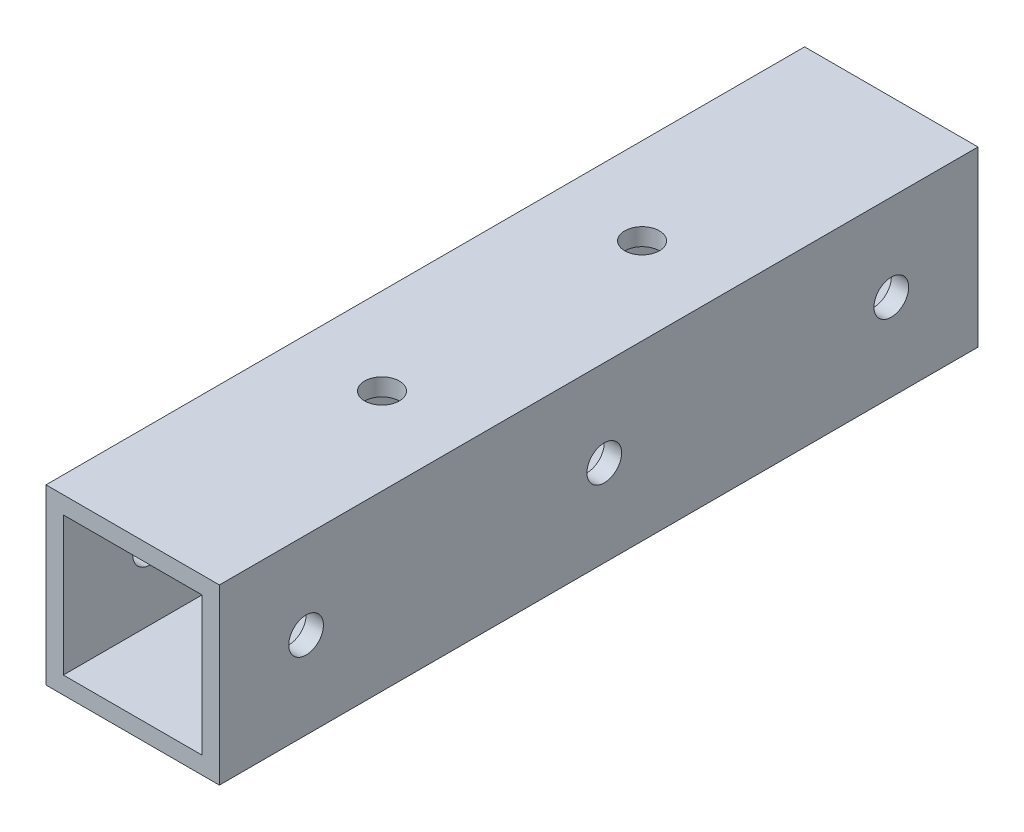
ISO-10303-21;
HEADER;
FILE_DESCRIPTION(('STEP AP214'),'2;1');
FILE_NAME('part.step','',(''),(''),'','','');
FILE_SCHEMA(('AUTOMOTIVE_DESIGN { 1 0 10303 214 1 1 1 1 }'));
ENDSEC;
DATA;
#1=APPLICATION_CONTEXT('core data for automotive mechanical design processes');
#2=APPLICATION_PROTOCOL_DEFINITION('international standard','automotive_design',2000,#1);
#3=PRODUCT_CONTEXT('',#1,'mechanical');
#4=PRODUCT('Part','Part','',(#3));
#5=PRODUCT_RELATED_PRODUCT_CATEGORY('part','',(#4));
#6=PRODUCT_DEFINITION_FORMATION('','',#4);
#7=PRODUCT_DEFINITION_CONTEXT('part definition',#1,'design');
#8=PRODUCT_DEFINITION('design','',#6,#7);
#9=PRODUCT_DEFINITION_SHAPE('','',#8);
#10=(LENGTH_UNIT() NAMED_UNIT(*) SI_UNIT(.MILLI.,.METRE.));
#11=(NAMED_UNIT(*) PLANE_ANGLE_UNIT() SI_UNIT($,.RADIAN.));
#12=(NAMED_UNIT(*) SI_UNIT($,.STERADIAN.) SOLID_ANGLE_UNIT());
#13=UNCERTAINTY_MEASURE_WITH_UNIT(LENGTH_MEASURE(1.E-05),#10,'distance_accuracy_value','');
#14=(GEOMETRIC_REPRESENTATION_CONTEXT(3) GLOBAL_UNCERTAINTY_ASSIGNED_CONTEXT((#13)) GLOBAL_UNIT_ASSIGNED_CONTEXT((#10,
#11,#12)) REPRESENTATION_CONTEXT('',''));
#15=CARTESIAN_POINT('',(0.,0.,0.));
#16=DIRECTION('',(0.,0.,1.));
#17=DIRECTION('',(1.,0.,0.));
#18=AXIS2_PLACEMENT_3D('',#15,#16,#17);
#19=CARTESIAN_POINT('',(0.,0.,87.5));
#20=DIRECTION('',(0.,0.,1.));
#21=DIRECTION('',(1.,0.,0.));
#22=AXIS2_PLACEMENT_3D('',#19,#20,#21);
#23=PLANE('',#22);
#24=DIRECTION('',(0.,1.,0.));
#25=VECTOR('',#24,1.);
#26=CARTESIAN_POINT('',(10.,10.,87.5));
#27=LINE('',#26,#25);
#28=CARTESIAN_POINT('',(10.,-10.,87.5));
#29=VERTEX_POINT('',#28);
#30=CARTESIAN_POINT('',(10.,10.,87.5));
#31=VERTEX_POINT('',#30);
#32=EDGE_CURVE('E140',#29,#31,#27,.T.);
#33=ORIENTED_EDGE('',*,*,#32,.T.);
#34=DIRECTION('',(-1.,0.,0.));
#35=VECTOR('',#34,1.);
#36=CARTESIAN_POINT('',(-10.,10.,87.5));
#37=LINE('',#36,#35);
#38=CARTESIAN_POINT('',(-10.,10.,87.5));
#39=VERTEX_POINT('',#38);
#40=EDGE_CURVE('E143',#31,#39,#37,.T.);
#41=ORIENTED_EDGE('',*,*,#40,.T.);
#42=DIRECTION('',(0.,-1.,0.));
#43=VECTOR('',#42,1.);
#44=CARTESIAN_POINT('',(-10.,10.,87.5));
#45=LINE('',#44,#43);
#46=CARTESIAN_POINT('',(-9.99999999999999,-10.,87.5));
#47=VERTEX_POINT('',#46);
#48=EDGE_CURVE('E146',#39,#47,#45,.T.);
#49=ORIENTED_EDGE('',*,*,#48,.T.);
#50=DIRECTION('',(1.,0.,0.));
#51=VECTOR('',#50,1.);
#52=CARTESIAN_POINT('',(-9.99999999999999,-10.,87.5));
#53=LINE('',#52,#51);
#54=EDGE_CURVE('E148',#47,#29,#53,.T.);
#55=ORIENTED_EDGE('',*,*,#54,.T.);
#56=EDGE_LOOP('',(#33,#41,#49,#55));
#57=FACE_BOUND('',#56,.T.);
#58=DIRECTION('',(1.,0.,0.));
#59=VECTOR('',#58,1.);
#60=CARTESIAN_POINT('',(-8.,-8.,87.5));
#61=LINE('',#60,#59);
#62=CARTESIAN_POINT('',(-8.,-8.,87.5));
#63=VERTEX_POINT('',#62);
#64=CARTESIAN_POINT('',(8.,-8.,87.5));
#65=VERTEX_POINT('',#64);
#66=EDGE_CURVE('E110',#63,#65,#61,.T.);
#67=ORIENTED_EDGE('',*,*,#66,.F.);
#68=DIRECTION('',(0.,-1.,0.));
#69=VECTOR('',#68,1.);
#70=CARTESIAN_POINT('',(-8.,8.,87.5));
#71=LINE('',#70,#69);
#72=CARTESIAN_POINT('',(-8.,8.,87.5));
#73=VERTEX_POINT('',#72);
#74=EDGE_CURVE('E102',#73,#63,#71,.T.);
#75=ORIENTED_EDGE('',*,*,#74,.F.);
#76=DIRECTION('',(-1.,0.,0.));
#77=VECTOR('',#76,1.);
#78=CARTESIAN_POINT('',(-8.,8.,87.5));
#79=LINE('',#78,#77);
#80=CARTESIAN_POINT('',(8.,8.,87.5));
#81=VERTEX_POINT('',#80);
#82=EDGE_CURVE('E124',#81,#73,#79,.T.);
#83=ORIENTED_EDGE('',*,*,#82,.F.);
#84=DIRECTION('',(0.,1.,0.));
#85=VECTOR('',#84,1.);
#86=CARTESIAN_POINT('',(8.,8.,87.5));
#87=LINE('',#86,#85);
#88=EDGE_CURVE('E122',#65,#81,#87,.T.);
#89=ORIENTED_EDGE('',*,*,#88,.F.);
#90=EDGE_LOOP('',(#67,#75,#83,#89));
#91=FACE_BOUND('',#90,.T.);
#92=ADVANCED_FACE('F35',(#57,#91),#23,.T.);
#93=CARTESIAN_POINT('',(0.,0.,0.));
#94=DIRECTION('',(0.,0.,1.));
#95=DIRECTION('',(1.,0.,0.));
#96=AXIS2_PLACEMENT_3D('',#93,#94,#95);
#97=PLANE('',#96);
#98=DIRECTION('',(0.,1.,0.));
#99=VECTOR('',#98,1.);
#100=CARTESIAN_POINT('',(10.,10.,0.));
#101=LINE('',#100,#99);
#102=CARTESIAN_POINT('',(10.,-10.,0.));
#103=VERTEX_POINT('',#102);
#104=CARTESIAN_POINT('',(10.,10.,0.));
#105=VERTEX_POINT('',#104);
#106=EDGE_CURVE('E118',#103,#105,#101,.T.);
#107=ORIENTED_EDGE('',*,*,#106,.F.);
#108=DIRECTION('',(1.,0.,0.));
#109=VECTOR('',#108,1.);
#110=CARTESIAN_POINT('',(-9.99999999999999,-10.,0.));
#111=LINE('',#110,#109);
#112=CARTESIAN_POINT('',(-9.99999999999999,-10.,0.));
#113=VERTEX_POINT('',#112);
#114=EDGE_CURVE('E144',#113,#103,#111,.T.);
#115=ORIENTED_EDGE('',*,*,#114,.F.);
#116=DIRECTION('',(0.,-1.,0.));
#117=VECTOR('',#116,1.);
#118=CARTESIAN_POINT('',(-10.,10.,0.));
#119=LINE('',#118,#117);
#120=CARTESIAN_POINT('',(-10.,10.,0.));
#121=VERTEX_POINT('',#120);
#122=EDGE_CURVE('E155',#121,#113,#119,.T.);
#123=ORIENTED_EDGE('',*,*,#122,.F.);
#124=DIRECTION('',(-1.,0.,0.));
#125=VECTOR('',#124,1.);
#126=CARTESIAN_POINT('',(-10.,10.,0.));
#127=LINE('',#126,#125);
#128=EDGE_CURVE('E153',#105,#121,#127,.T.);
#129=ORIENTED_EDGE('',*,*,#128,.F.);
#130=EDGE_LOOP('',(#107,#115,#123,#129));
#131=FACE_BOUND('',#130,.T.);
#132=DIRECTION('',(0.,-1.,0.));
#133=VECTOR('',#132,1.);
#134=CARTESIAN_POINT('',(-8.,8.,0.));
#135=LINE('',#134,#133);
#136=CARTESIAN_POINT('',(-8.,8.,0.));
#137=VERTEX_POINT('',#136);
#138=CARTESIAN_POINT('',(-8.,-8.,0.));
#139=VERTEX_POINT('',#138);
#140=EDGE_CURVE('E60',#137,#139,#135,.T.);
#141=ORIENTED_EDGE('',*,*,#140,.T.);
#142=DIRECTION('',(1.,0.,0.));
#143=VECTOR('',#142,1.);
#144=CARTESIAN_POINT('',(-8.,-8.,0.));
#145=LINE('',#144,#143);
#146=CARTESIAN_POINT('',(8.,-8.,0.));
#147=VERTEX_POINT('',#146);
#148=EDGE_CURVE('E117',#139,#147,#145,.T.);
#149=ORIENTED_EDGE('',*,*,#148,.T.);
#150=DIRECTION('',(0.,1.,0.));
#151=VECTOR('',#150,1.);
#152=CARTESIAN_POINT('',(8.,8.,0.));
#153=LINE('',#152,#151);
#154=CARTESIAN_POINT('',(8.,8.,0.));
#155=VERTEX_POINT('',#154);
#156=EDGE_CURVE('E132',#147,#155,#153,.T.);
#157=ORIENTED_EDGE('',*,*,#156,.T.);
#158=DIRECTION('',(-1.,0.,0.));
#159=VECTOR('',#158,1.);
#160=CARTESIAN_POINT('',(-8.,8.,0.));
#161=LINE('',#160,#159);
#162=EDGE_CURVE('E111',#155,#137,#161,.T.);
#163=ORIENTED_EDGE('',*,*,#162,.T.);
#164=EDGE_LOOP('',(#141,#149,#157,#163));
#165=FACE_BOUND('',#164,.T.);
#166=ADVANCED_FACE('F238',(#131,#165),#97,.F.);
#167=CARTESIAN_POINT('',(10.,10.,87.5));
#168=DIRECTION('',(-1.,0.,0.));
#169=DIRECTION('',(0.,-1.,0.));
#170=AXIS2_PLACEMENT_3D('',#167,#168,#169);
#171=PLANE('',#170);
#172=CARTESIAN_POINT('',(10.,-5.0038098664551E-12,10.0000000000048));
#173=DIRECTION('',(-1.,0.,0.));
#174=DIRECTION('',(0.,0.,1.));
#175=AXIS2_PLACEMENT_3D('',#172,#173,#174);
#176=CIRCLE('',#175,2.);
#177=CARTESIAN_POINT('',(10.,-5.0038098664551E-12,12.0000000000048));
#178=VERTEX_POINT('',#177);
#179=EDGE_CURVE('E177',#178,#178,#176,.T.);
#180=ORIENTED_EDGE('',*,*,#179,.T.);
#181=EDGE_LOOP('',(#180));
#182=FACE_BOUND('',#181,.T.);
#183=CARTESIAN_POINT('',(10.,-4.99687097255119E-12,43.1090522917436));
#184=DIRECTION('',(-1.,0.,0.));
#185=DIRECTION('',(0.,0.,1.));
#186=AXIS2_PLACEMENT_3D('',#183,#184,#185);
#187=CIRCLE('',#186,2.);
#188=CARTESIAN_POINT('',(10.,-4.99687097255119E-12,45.1090522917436));
#189=VERTEX_POINT('',#188);
#190=EDGE_CURVE('E173',#189,#189,#187,.T.);
#191=ORIENTED_EDGE('',*,*,#190,.T.);
#192=EDGE_LOOP('',(#191));
#193=FACE_BOUND('',#192,.T.);
#194=CARTESIAN_POINT('',(10.,-4.98993207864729E-12,77.5000000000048));
#195=DIRECTION('',(-1.,0.,0.));
#196=DIRECTION('',(0.,0.,1.));
#197=AXIS2_PLACEMENT_3D('',#194,#195,#196);
#198=CIRCLE('',#197,2.);
#199=CARTESIAN_POINT('',(10.,-4.98993207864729E-12,79.5000000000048));
#200=VERTEX_POINT('',#199);
#201=EDGE_CURVE('E168',#200,#200,#198,.T.);
#202=ORIENTED_EDGE('',*,*,#201,.T.);
#203=EDGE_LOOP('',(#202));
#204=FACE_BOUND('',#203,.T.);
#205=ORIENTED_EDGE('',*,*,#106,.T.);
#206=DIRECTION('',(0.,0.,-1.));
#207=VECTOR('',#206,1.);
#208=CARTESIAN_POINT('',(10.,10.,87.5));
#209=LINE('',#208,#207);
#210=EDGE_CURVE('E11',#31,#105,#209,.T.);
#211=ORIENTED_EDGE('',*,*,#210,.F.);
#212=ORIENTED_EDGE('',*,*,#32,.F.);
#213=DIRECTION('',(0.,0.,-1.));
#214=VECTOR('',#213,1.);
#215=CARTESIAN_POINT('',(10.,-10.,87.5));
#216=LINE('',#215,#214);
#217=EDGE_CURVE('E150',#29,#103,#216,.T.);
#218=ORIENTED_EDGE('',*,*,#217,.T.);
#219=EDGE_LOOP('',(#205,#211,#212,#218));
#220=FACE_BOUND('',#219,.T.);
#221=ADVANCED_FACE('F37',(#182,#193,#204,#220),#171,.F.);
#222=CARTESIAN_POINT('',(-10.,10.,87.5));
#223=DIRECTION('',(0.,-1.,0.));
#224=DIRECTION('',(0.,0.,-1.));
#225=AXIS2_PLACEMENT_3D('',#222,#223,#224);
#226=PLANE('',#225);
#227=CARTESIAN_POINT('',(0.,10.,58.75));
#228=DIRECTION('',(0.,1.,0.));
#229=DIRECTION('',(0.,0.,1.));
#230=AXIS2_PLACEMENT_3D('',#227,#228,#229);
#231=CIRCLE('',#230,1.99999999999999);
#232=CARTESIAN_POINT('',(0.,10.,60.75));
#233=VERTEX_POINT('',#232);
#234=EDGE_CURVE('E258',#233,#233,#231,.T.);
#235=ORIENTED_EDGE('',*,*,#234,.F.);
#236=EDGE_LOOP('',(#235));
#237=FACE_BOUND('',#236,.T.);
#238=CARTESIAN_POINT('',(0.,10.,28.75));
#239=DIRECTION('',(0.,1.,0.));
#240=DIRECTION('',(0.,0.,1.));
#241=AXIS2_PLACEMENT_3D('',#238,#239,#240);
#242=CIRCLE('',#241,1.99999999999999);
#243=CARTESIAN_POINT('',(0.,10.,30.75));
#244=VERTEX_POINT('',#243);
#245=EDGE_CURVE('E188',#244,#244,#242,.T.);
#246=ORIENTED_EDGE('',*,*,#245,.F.);
#247=EDGE_LOOP('',(#246));
#248=FACE_BOUND('',#247,.T.);
#249=ORIENTED_EDGE('',*,*,#128,.T.);
#250=DIRECTION('',(0.,0.,-1.));
#251=VECTOR('',#250,1.);
#252=CARTESIAN_POINT('',(-10.,10.,87.5));
#253=LINE('',#252,#251);
#254=EDGE_CURVE('E44',#39,#121,#253,.T.);
#255=ORIENTED_EDGE('',*,*,#254,.F.);
#256=ORIENTED_EDGE('',*,*,#40,.F.);
#257=ORIENTED_EDGE('',*,*,#210,.T.);
#258=EDGE_LOOP('',(#249,#255,#256,#257));
#259=FACE_BOUND('',#258,.T.);
#260=ADVANCED_FACE('F247',(#237,#248,#259),#226,.F.);
#261=CARTESIAN_POINT('',(-10.,10.,87.5));
#262=DIRECTION('',(1.,0.,0.));
#263=DIRECTION('',(0.,1.,0.));
#264=AXIS2_PLACEMENT_3D('',#261,#262,#263);
#265=PLANE('',#264);
#266=CARTESIAN_POINT('',(-10.,-5.0038098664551E-12,10.0000000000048));
#267=DIRECTION('',(-1.,0.,0.));
#268=DIRECTION('',(0.,0.,1.));
#269=AXIS2_PLACEMENT_3D('',#266,#267,#268);
#270=CIRCLE('',#269,1.99999999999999);
#271=CARTESIAN_POINT('',(-10.,-5.0038098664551E-12,12.0000000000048));
#272=VERTEX_POINT('',#271);
#273=EDGE_CURVE('E185',#272,#272,#270,.T.);
#274=ORIENTED_EDGE('',*,*,#273,.F.);
#275=EDGE_LOOP('',(#274));
#276=FACE_BOUND('',#275,.T.);
#277=CARTESIAN_POINT('',(-10.,-4.99687097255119E-12,43.1090522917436));
#278=DIRECTION('',(-1.,0.,0.));
#279=DIRECTION('',(0.,0.,1.));
#280=AXIS2_PLACEMENT_3D('',#277,#278,#279);
#281=CIRCLE('',#280,1.99999999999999);
#282=CARTESIAN_POINT('',(-10.,-4.99687097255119E-12,45.1090522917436));
#283=VERTEX_POINT('',#282);
#284=EDGE_CURVE('E203',#283,#283,#281,.T.);
#285=ORIENTED_EDGE('',*,*,#284,.F.);
#286=EDGE_LOOP('',(#285));
#287=FACE_BOUND('',#286,.T.);
#288=CARTESIAN_POINT('',(-10.,-4.98993207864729E-12,77.5000000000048));
#289=DIRECTION('',(-1.,0.,0.));
#290=DIRECTION('',(0.,0.,1.));
#291=AXIS2_PLACEMENT_3D('',#288,#289,#290);
#292=CIRCLE('',#291,1.99999999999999);
#293=CARTESIAN_POINT('',(-10.,-4.98993207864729E-12,79.5000000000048));
#294=VERTEX_POINT('',#293);
#295=EDGE_CURVE('E210',#294,#294,#292,.T.);
#296=ORIENTED_EDGE('',*,*,#295,.F.);
#297=EDGE_LOOP('',(#296));
#298=FACE_BOUND('',#297,.T.);
#299=ORIENTED_EDGE('',*,*,#122,.T.);
#300=DIRECTION('',(0.,0.,-1.));
#301=VECTOR('',#300,1.);
#302=CARTESIAN_POINT('',(-9.99999999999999,-10.,87.5));
#303=LINE('',#302,#301);
#304=EDGE_CURVE('E160',#47,#113,#303,.T.);
#305=ORIENTED_EDGE('',*,*,#304,.F.);
#306=ORIENTED_EDGE('',*,*,#48,.F.);
#307=ORIENTED_EDGE('',*,*,#254,.T.);
#308=EDGE_LOOP('',(#299,#305,#306,#307));
#309=FACE_BOUND('',#308,.T.);
#310=ADVANCED_FACE('F231',(#276,#287,#298,#309),#265,.F.);
#311=CARTESIAN_POINT('',(-9.99999999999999,-10.,87.5));
#312=DIRECTION('',(0.,1.,0.));
#313=DIRECTION('',(0.,0.,1.));
#314=AXIS2_PLACEMENT_3D('',#311,#312,#313);
#315=PLANE('',#314);
#316=CARTESIAN_POINT('',(0.,-10.,58.75));
#317=DIRECTION('',(0.,1.,0.));
#318=DIRECTION('',(0.,0.,1.));
#319=AXIS2_PLACEMENT_3D('',#316,#317,#318);
#320=CIRCLE('',#319,2.);
#321=CARTESIAN_POINT('',(0.,-10.,60.75));
#322=VERTEX_POINT('',#321);
#323=EDGE_CURVE('E318',#322,#322,#320,.T.);
#324=ORIENTED_EDGE('',*,*,#323,.T.);
#325=EDGE_LOOP('',(#324));
#326=FACE_BOUND('',#325,.T.);
#327=CARTESIAN_POINT('',(0.,-10.,28.75));
#328=DIRECTION('',(0.,1.,0.));
#329=DIRECTION('',(0.,0.,1.));
#330=AXIS2_PLACEMENT_3D('',#327,#328,#329);
#331=CIRCLE('',#330,2.);
#332=CARTESIAN_POINT('',(0.,-10.,30.75));
#333=VERTEX_POINT('',#332);
#334=EDGE_CURVE('E181',#333,#333,#331,.T.);
#335=ORIENTED_EDGE('',*,*,#334,.T.);
#336=EDGE_LOOP('',(#335));
#337=FACE_BOUND('',#336,.T.);
#338=ORIENTED_EDGE('',*,*,#114,.T.);
#339=ORIENTED_EDGE('',*,*,#217,.F.);
#340=ORIENTED_EDGE('',*,*,#54,.F.);
#341=ORIENTED_EDGE('',*,*,#304,.T.);
#342=EDGE_LOOP('',(#338,#339,#340,#341));
#343=FACE_BOUND('',#342,.T.);
#344=ADVANCED_FACE('F221',(#326,#337,#343),#315,.F.);
#345=CARTESIAN_POINT('',(-8.,8.,87.5));
#346=DIRECTION('',(1.,0.,0.));
#347=DIRECTION('',(0.,0.,-1.));
#348=AXIS2_PLACEMENT_3D('',#345,#346,#347);
#349=PLANE('',#348);
#350=CARTESIAN_POINT('',(-8.,-5.0038098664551E-12,10.0000000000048));
#351=DIRECTION('',(1.,0.,0.));
#352=DIRECTION('',(0.,0.,-1.));
#353=AXIS2_PLACEMENT_3D('',#350,#351,#352);
#354=CIRCLE('',#353,1.99999999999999);
#355=CARTESIAN_POINT('',(-8.,-5.0038098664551E-12,8.00000000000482));
#356=VERTEX_POINT('',#355);
#357=EDGE_CURVE('E176',#356,#356,#354,.T.);
#358=ORIENTED_EDGE('',*,*,#357,.F.);
#359=EDGE_LOOP('',(#358));
#360=FACE_BOUND('',#359,.T.);
#361=CARTESIAN_POINT('',(-8.,-4.99687097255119E-12,43.1090522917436));
#362=DIRECTION('',(1.,0.,0.));
#363=DIRECTION('',(0.,0.,-1.));
#364=AXIS2_PLACEMENT_3D('',#361,#362,#363);
#365=CIRCLE('',#364,1.99999999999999);
#366=CARTESIAN_POINT('',(-8.,-4.99687097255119E-12,41.1090522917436));
#367=VERTEX_POINT('',#366);
#368=EDGE_CURVE('E169',#367,#367,#365,.T.);
#369=ORIENTED_EDGE('',*,*,#368,.F.);
#370=EDGE_LOOP('',(#369));
#371=FACE_BOUND('',#370,.T.);
#372=CARTESIAN_POINT('',(-8.,-4.98993207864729E-12,77.5000000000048));
#373=DIRECTION('',(1.,0.,0.));
#374=DIRECTION('',(0.,0.,-1.));
#375=AXIS2_PLACEMENT_3D('',#372,#373,#374);
#376=CIRCLE('',#375,1.99999999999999);
#377=CARTESIAN_POINT('',(-8.,-4.98993207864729E-12,75.5000000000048));
#378=VERTEX_POINT('',#377);
#379=EDGE_CURVE('E130',#378,#378,#376,.T.);
#380=ORIENTED_EDGE('',*,*,#379,.F.);
#381=EDGE_LOOP('',(#380));
#382=FACE_BOUND('',#381,.T.);
#383=ORIENTED_EDGE('',*,*,#140,.F.);
#384=DIRECTION('',(0.,0.,-1.));
#385=VECTOR('',#384,1.);
#386=CARTESIAN_POINT('',(-8.,8.,87.5));
#387=LINE('',#386,#385);
#388=EDGE_CURVE('E106',#73,#137,#387,.T.);
#389=ORIENTED_EDGE('',*,*,#388,.F.);
#390=ORIENTED_EDGE('',*,*,#74,.T.);
#391=DIRECTION('',(0.,0.,-1.));
#392=VECTOR('',#391,1.);
#393=CARTESIAN_POINT('',(-8.,-8.,87.5));
#394=LINE('',#393,#392);
#395=EDGE_CURVE('E105',#63,#139,#394,.T.);
#396=ORIENTED_EDGE('',*,*,#395,.T.);
#397=EDGE_LOOP('',(#383,#389,#390,#396));
#398=FACE_BOUND('',#397,.T.);
#399=ADVANCED_FACE('F104',(#360,#371,#382,#398),#349,.T.);
#400=CARTESIAN_POINT('',(-8.,-8.,87.5));
#401=DIRECTION('',(0.,1.,0.));
#402=DIRECTION('',(-1.,0.,0.));
#403=AXIS2_PLACEMENT_3D('',#400,#401,#402);
#404=PLANE('',#403);
#405=CARTESIAN_POINT('',(0.,-8.,58.75));
#406=DIRECTION('',(0.,1.,0.));
#407=DIRECTION('',(-1.,0.,0.));
#408=AXIS2_PLACEMENT_3D('',#405,#406,#407);
#409=CIRCLE('',#408,1.99999999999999);
#410=CARTESIAN_POINT('',(-1.99999999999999,-8.,58.75));
#411=VERTEX_POINT('',#410);
#412=EDGE_CURVE('E193',#411,#411,#409,.T.);
#413=ORIENTED_EDGE('',*,*,#412,.F.);
#414=EDGE_LOOP('',(#413));
#415=FACE_BOUND('',#414,.T.);
#416=CARTESIAN_POINT('',(0.,-8.,28.75));
#417=DIRECTION('',(0.,1.,0.));
#418=DIRECTION('',(-1.,0.,0.));
#419=AXIS2_PLACEMENT_3D('',#416,#417,#418);
#420=CIRCLE('',#419,1.99999999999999);
#421=CARTESIAN_POINT('',(-1.99999999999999,-8.,28.75));
#422=VERTEX_POINT('',#421);
#423=EDGE_CURVE('E180',#422,#422,#420,.T.);
#424=ORIENTED_EDGE('',*,*,#423,.F.);
#425=EDGE_LOOP('',(#424));
#426=FACE_BOUND('',#425,.T.);
#427=ORIENTED_EDGE('',*,*,#148,.F.);
#428=ORIENTED_EDGE('',*,*,#395,.F.);
#429=ORIENTED_EDGE('',*,*,#66,.T.);
#430=DIRECTION('',(0.,0.,-1.));
#431=VECTOR('',#430,1.);
#432=CARTESIAN_POINT('',(8.,-8.,87.5));
#433=LINE('',#432,#431);
#434=EDGE_CURVE('E119',#65,#147,#433,.T.);
#435=ORIENTED_EDGE('',*,*,#434,.T.);
#436=EDGE_LOOP('',(#427,#428,#429,#435));
#437=FACE_BOUND('',#436,.T.);
#438=ADVANCED_FACE('F114',(#415,#426,#437),#404,.T.);
#439=CARTESIAN_POINT('',(8.,8.,87.5));
#440=DIRECTION('',(-1.,0.,0.));
#441=DIRECTION('',(0.,0.,1.));
#442=AXIS2_PLACEMENT_3D('',#439,#440,#441);
#443=PLANE('',#442);
#444=CARTESIAN_POINT('',(8.,-5.0038098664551E-12,10.0000000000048));
#445=DIRECTION('',(-1.,0.,0.));
#446=DIRECTION('',(0.,0.,1.));
#447=AXIS2_PLACEMENT_3D('',#444,#445,#446);
#448=CIRCLE('',#447,1.99999999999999);
#449=CARTESIAN_POINT('',(8.,-5.0038098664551E-12,12.0000000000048));
#450=VERTEX_POINT('',#449);
#451=EDGE_CURVE('E174',#450,#450,#448,.T.);
#452=ORIENTED_EDGE('',*,*,#451,.F.);
#453=EDGE_LOOP('',(#452));
#454=FACE_BOUND('',#453,.T.);
#455=CARTESIAN_POINT('',(8.,-4.99687097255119E-12,43.1090522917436));
#456=DIRECTION('',(-1.,0.,0.));
#457=DIRECTION('',(0.,0.,1.));
#458=AXIS2_PLACEMENT_3D('',#455,#456,#457);
#459=CIRCLE('',#458,1.99999999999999);
#460=CARTESIAN_POINT('',(8.,-4.99687097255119E-12,45.1090522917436));
#461=VERTEX_POINT('',#460);
#462=EDGE_CURVE('E172',#461,#461,#459,.T.);
#463=ORIENTED_EDGE('',*,*,#462,.F.);
#464=EDGE_LOOP('',(#463));
#465=FACE_BOUND('',#464,.T.);
#466=CARTESIAN_POINT('',(8.,-4.98993207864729E-12,77.5000000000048));
#467=DIRECTION('',(-1.,0.,0.));
#468=DIRECTION('',(0.,0.,1.));
#469=AXIS2_PLACEMENT_3D('',#466,#467,#468);
#470=CIRCLE('',#469,1.99999999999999);
#471=CARTESIAN_POINT('',(8.,-4.98993207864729E-12,79.5000000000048));
#472=VERTEX_POINT('',#471);
#473=EDGE_CURVE('E165',#472,#472,#470,.T.);
#474=ORIENTED_EDGE('',*,*,#473,.F.);
#475=EDGE_LOOP('',(#474));
#476=FACE_BOUND('',#475,.T.);
#477=ORIENTED_EDGE('',*,*,#156,.F.);
#478=ORIENTED_EDGE('',*,*,#434,.F.);
#479=ORIENTED_EDGE('',*,*,#88,.T.);
#480=DIRECTION('',(0.,0.,-1.));
#481=VECTOR('',#480,1.);
#482=CARTESIAN_POINT('',(8.,8.,87.5));
#483=LINE('',#482,#481);
#484=EDGE_CURVE('E52',#81,#155,#483,.T.);
#485=ORIENTED_EDGE('',*,*,#484,.T.);
#486=EDGE_LOOP('',(#477,#478,#479,#485));
#487=FACE_BOUND('',#486,.T.);
#488=ADVANCED_FACE('F228',(#454,#465,#476,#487),#443,.T.);
#489=CARTESIAN_POINT('',(-8.,8.,87.5));
#490=DIRECTION('',(0.,-1.,0.));
#491=DIRECTION('',(0.,0.,-1.));
#492=AXIS2_PLACEMENT_3D('',#489,#490,#491);
#493=PLANE('',#492);
#494=CARTESIAN_POINT('',(0.,8.,58.75));
#495=DIRECTION('',(0.,-1.,0.));
#496=DIRECTION('',(0.,0.,-1.));
#497=AXIS2_PLACEMENT_3D('',#494,#495,#496);
#498=CIRCLE('',#497,1.99999999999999);
#499=CARTESIAN_POINT('',(0.,8.,56.75));
#500=VERTEX_POINT('',#499);
#501=EDGE_CURVE('E39',#500,#500,#498,.T.);
#502=ORIENTED_EDGE('',*,*,#501,.F.);
#503=EDGE_LOOP('',(#502));
#504=FACE_BOUND('',#503,.T.);
#505=CARTESIAN_POINT('',(0.,8.,28.75));
#506=DIRECTION('',(0.,-1.,0.));
#507=DIRECTION('',(0.,0.,-1.));
#508=AXIS2_PLACEMENT_3D('',#505,#506,#507);
#509=CIRCLE('',#508,1.99999999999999);
#510=CARTESIAN_POINT('',(0.,8.,26.75));
#511=VERTEX_POINT('',#510);
#512=EDGE_CURVE('E178',#511,#511,#509,.T.);
#513=ORIENTED_EDGE('',*,*,#512,.F.);
#514=EDGE_LOOP('',(#513));
#515=FACE_BOUND('',#514,.T.);
#516=ORIENTED_EDGE('',*,*,#162,.F.);
#517=ORIENTED_EDGE('',*,*,#484,.F.);
#518=ORIENTED_EDGE('',*,*,#82,.T.);
#519=ORIENTED_EDGE('',*,*,#388,.T.);
#520=EDGE_LOOP('',(#516,#517,#518,#519));
#521=FACE_BOUND('',#520,.T.);
#522=ADVANCED_FACE('F276',(#504,#515,#521),#493,.T.);
#523=CARTESIAN_POINT('',(-9.99999999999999,-4.98993207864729E-12,77.5000000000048));
#524=DIRECTION('',(-1.,0.,0.));
#525=DIRECTION('',(0.,0.,1.));
#526=AXIS2_PLACEMENT_3D('',#523,#524,#525);
#527=CYLINDRICAL_SURFACE('',#526,1.99999999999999);
#528=ORIENTED_EDGE('',*,*,#473,.T.);
#529=EDGE_LOOP('',(#528));
#530=FACE_BOUND('',#529,.T.);
#531=ORIENTED_EDGE('',*,*,#201,.F.);
#532=EDGE_LOOP('',(#531));
#533=FACE_BOUND('',#532,.T.);
#534=ADVANCED_FACE('F278',(#530,#533),#527,.F.);
#535=ORIENTED_EDGE('',*,*,#379,.T.);
#536=EDGE_LOOP('',(#535));
#537=FACE_BOUND('',#536,.T.);
#538=ORIENTED_EDGE('',*,*,#295,.T.);
#539=EDGE_LOOP('',(#538));
#540=FACE_BOUND('',#539,.T.);
#541=ADVANCED_FACE('F217',(#537,#540),#527,.F.);
#542=CARTESIAN_POINT('',(-9.99999999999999,-4.99687097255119E-12,43.1090522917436));
#543=DIRECTION('',(-1.,0.,0.));
#544=DIRECTION('',(0.,0.,1.));
#545=AXIS2_PLACEMENT_3D('',#542,#543,#544);
#546=CYLINDRICAL_SURFACE('',#545,1.99999999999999);
#547=ORIENTED_EDGE('',*,*,#368,.T.);
#548=EDGE_LOOP('',(#547));
#549=FACE_BOUND('',#548,.T.);
#550=ORIENTED_EDGE('',*,*,#284,.T.);
#551=EDGE_LOOP('',(#550));
#552=FACE_BOUND('',#551,.T.);
#553=ADVANCED_FACE('F292',(#549,#552),#546,.F.);
#554=ORIENTED_EDGE('',*,*,#462,.T.);
#555=EDGE_LOOP('',(#554));
#556=FACE_BOUND('',#555,.T.);
#557=ORIENTED_EDGE('',*,*,#190,.F.);
#558=EDGE_LOOP('',(#557));
#559=FACE_BOUND('',#558,.T.);
#560=ADVANCED_FACE('F295',(#556,#559),#546,.F.);
#561=CARTESIAN_POINT('',(-9.99999999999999,-5.0038098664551E-12,10.0000000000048));
#562=DIRECTION('',(-1.,0.,0.));
#563=DIRECTION('',(0.,0.,1.));
#564=AXIS2_PLACEMENT_3D('',#561,#562,#563);
#565=CYLINDRICAL_SURFACE('',#564,1.99999999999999);
#566=ORIENTED_EDGE('',*,*,#451,.T.);
#567=EDGE_LOOP('',(#566));
#568=FACE_BOUND('',#567,.T.);
#569=ORIENTED_EDGE('',*,*,#179,.F.);
#570=EDGE_LOOP('',(#569));
#571=FACE_BOUND('',#570,.T.);
#572=ADVANCED_FACE('F297',(#568,#571),#565,.F.);
#573=ORIENTED_EDGE('',*,*,#357,.T.);
#574=EDGE_LOOP('',(#573));
#575=FACE_BOUND('',#574,.T.);
#576=ORIENTED_EDGE('',*,*,#273,.T.);
#577=EDGE_LOOP('',(#576));
#578=FACE_BOUND('',#577,.T.);
#579=ADVANCED_FACE('F300',(#575,#578),#565,.F.);
#580=CARTESIAN_POINT('',(0.,10.,28.75));
#581=DIRECTION('',(0.,1.,0.));
#582=DIRECTION('',(0.,0.,1.));
#583=AXIS2_PLACEMENT_3D('',#580,#581,#582);
#584=CYLINDRICAL_SURFACE('',#583,1.99999999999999);
#585=ORIENTED_EDGE('',*,*,#512,.T.);
#586=EDGE_LOOP('',(#585));
#587=FACE_BOUND('',#586,.T.);
#588=ORIENTED_EDGE('',*,*,#245,.T.);
#589=EDGE_LOOP('',(#588));
#590=FACE_BOUND('',#589,.T.);
#591=ADVANCED_FACE('F302',(#587,#590),#584,.F.);
#592=ORIENTED_EDGE('',*,*,#423,.T.);
#593=EDGE_LOOP('',(#592));
#594=FACE_BOUND('',#593,.T.);
#595=ORIENTED_EDGE('',*,*,#334,.F.);
#596=EDGE_LOOP('',(#595));
#597=FACE_BOUND('',#596,.T.);
#598=ADVANCED_FACE('F305',(#594,#597),#584,.F.);
#599=CARTESIAN_POINT('',(0.,10.,58.75));
#600=DIRECTION('',(0.,1.,0.));
#601=DIRECTION('',(0.,0.,1.));
#602=AXIS2_PLACEMENT_3D('',#599,#600,#601);
#603=CYLINDRICAL_SURFACE('',#602,1.99999999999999);
#604=ORIENTED_EDGE('',*,*,#501,.T.);
#605=EDGE_LOOP('',(#604));
#606=FACE_BOUND('',#605,.T.);
#607=ORIENTED_EDGE('',*,*,#234,.T.);
#608=EDGE_LOOP('',(#607));
#609=FACE_BOUND('',#608,.T.);
#610=ADVANCED_FACE('F306',(#606,#609),#603,.F.);
#611=ORIENTED_EDGE('',*,*,#412,.T.);
#612=EDGE_LOOP('',(#611));
#613=FACE_BOUND('',#612,.T.);
#614=ORIENTED_EDGE('',*,*,#323,.F.);
#615=EDGE_LOOP('',(#614));
#616=FACE_BOUND('',#615,.T.);
#617=ADVANCED_FACE('F308',(#613,#616),#603,.F.);
#618=CLOSED_SHELL('',(#92,#166,#221,#260,#310,#344,#399,#438,#488,#522,#534,#541,#553,#560,#572,
#579,#591,#598,#610,#617));
#619=MANIFOLD_SOLID_BREP('B2',#618);
#620=ADVANCED_BREP_SHAPE_REPRESENTATION('',(#18,#619),#14);
#621=SHAPE_DEFINITION_REPRESENTATION(#9,#620);
ENDSEC;
END-ISO-10303-21;
